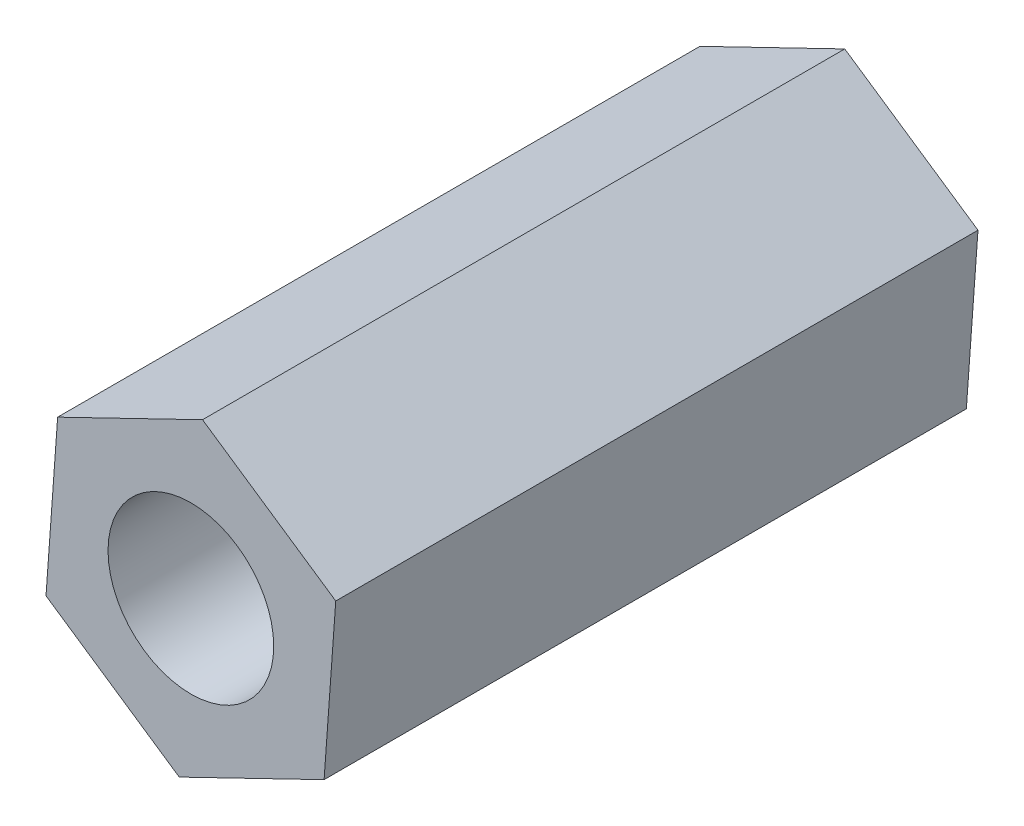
ISO-10303-21;
HEADER;
FILE_DESCRIPTION(('STEP AP214'),'2;1');
FILE_NAME('part.step','',(''),(''),'','','');
FILE_SCHEMA(('AUTOMOTIVE_DESIGN { 1 0 10303 214 1 1 1 1 }'));
ENDSEC;
DATA;
#1=APPLICATION_CONTEXT('core data for automotive mechanical design processes');
#2=APPLICATION_PROTOCOL_DEFINITION('international standard','automotive_design',2000,#1);
#3=PRODUCT_CONTEXT('',#1,'mechanical');
#4=PRODUCT('Part','Part','',(#3));
#5=PRODUCT_RELATED_PRODUCT_CATEGORY('part','',(#4));
#6=PRODUCT_DEFINITION_FORMATION('','',#4);
#7=PRODUCT_DEFINITION_CONTEXT('part definition',#1,'design');
#8=PRODUCT_DEFINITION('design','',#6,#7);
#9=PRODUCT_DEFINITION_SHAPE('','',#8);
#10=(LENGTH_UNIT() NAMED_UNIT(*) SI_UNIT(.MILLI.,.METRE.));
#11=(NAMED_UNIT(*) PLANE_ANGLE_UNIT() SI_UNIT($,.RADIAN.));
#12=(NAMED_UNIT(*) SI_UNIT($,.STERADIAN.) SOLID_ANGLE_UNIT());
#13=UNCERTAINTY_MEASURE_WITH_UNIT(LENGTH_MEASURE(1.E-05),#10,'distance_accuracy_value','');
#14=(GEOMETRIC_REPRESENTATION_CONTEXT(3) GLOBAL_UNCERTAINTY_ASSIGNED_CONTEXT((#13)) GLOBAL_UNIT_ASSIGNED_CONTEXT((#10,
#11,#12)) REPRESENTATION_CONTEXT('',''));
#15=CARTESIAN_POINT('',(0.,0.,0.));
#16=DIRECTION('',(0.,0.,1.));
#17=DIRECTION('',(1.,0.,0.));
#18=AXIS2_PLACEMENT_3D('',#15,#16,#17);
#19=CARTESIAN_POINT('',(0.,0.,10.));
#20=DIRECTION('',(0.,0.,1.));
#21=DIRECTION('',(1.,0.,0.));
#22=AXIS2_PLACEMENT_3D('',#19,#20,#21);
#23=PLANE('',#22);
#24=DIRECTION('',(0.827581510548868,-0.561345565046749,0.));
#25=VECTOR('',#24,1.);
#26=CARTESIAN_POINT('',(-39.3700886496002,-1.09294876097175,10.));
#27=LINE('',#26,#25);
#28=CARTESIAN_POINT('',(-39.3700886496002,-1.09294876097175,10.));
#29=VERTEX_POINT('',#28);
#30=CARTESIAN_POINT('',(-37.2956987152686,-2.49999999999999,10.));
#31=VERTEX_POINT('',#30);
#32=EDGE_CURVE('E129',#29,#31,#27,.T.);
#33=ORIENTED_EDGE('',*,*,#32,.T.);
#34=DIRECTION('',(0.899930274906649,0.436033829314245,0.));
#35=VECTOR('',#34,1.);
#36=CARTESIAN_POINT('',(-37.2956987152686,-2.49999999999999,10.));
#37=LINE('',#36,#35);
#38=CARTESIAN_POINT('',(-35.039961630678,-1.40705123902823,10.));
#39=VERTEX_POINT('',#38);
#40=EDGE_CURVE('E87',#31,#39,#37,.T.);
#41=ORIENTED_EDGE('',*,*,#40,.T.);
#42=DIRECTION('',(0.0723487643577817,0.997379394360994,0.));
#43=VECTOR('',#42,1.);
#44=CARTESIAN_POINT('',(-35.039961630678,-1.40705123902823,10.));
#45=LINE('',#44,#43);
#46=CARTESIAN_POINT('',(-34.858614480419,1.09294876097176,10.));
#47=VERTEX_POINT('',#46);
#48=EDGE_CURVE('E100',#39,#47,#45,.T.);
#49=ORIENTED_EDGE('',*,*,#48,.T.);
#50=DIRECTION('',(-0.827581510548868,0.561345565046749,0.));
#51=VECTOR('',#50,1.);
#52=CARTESIAN_POINT('',(-34.858614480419,1.09294876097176,10.));
#53=LINE('',#52,#51);
#54=CARTESIAN_POINT('',(-36.9330044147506,2.5,10.));
#55=VERTEX_POINT('',#54);
#56=EDGE_CURVE('E94',#47,#55,#53,.T.);
#57=ORIENTED_EDGE('',*,*,#56,.T.);
#58=DIRECTION('',(-0.89993027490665,-0.436033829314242,0.));
#59=VECTOR('',#58,1.);
#60=CARTESIAN_POINT('',(-36.9330044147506,2.5,10.));
#61=LINE('',#60,#59);
#62=CARTESIAN_POINT('',(-39.1887414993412,1.40705123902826,10.));
#63=VERTEX_POINT('',#62);
#64=EDGE_CURVE('E98',#55,#63,#61,.T.);
#65=ORIENTED_EDGE('',*,*,#64,.T.);
#66=DIRECTION('',(-0.072348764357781,-0.997379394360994,0.));
#67=VECTOR('',#66,1.);
#68=CARTESIAN_POINT('',(-39.1887414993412,1.40705123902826,10.));
#69=LINE('',#68,#67);
#70=EDGE_CURVE('E50',#63,#29,#69,.T.);
#71=ORIENTED_EDGE('',*,*,#70,.T.);
#72=EDGE_LOOP('',(#33,#41,#49,#57,#65,#71));
#73=FACE_BOUND('',#72,.T.);
#74=CARTESIAN_POINT('',(-37.1143515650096,0.,10.));
#75=DIRECTION('',(0.,0.,1.));
#76=DIRECTION('',(1.,0.,0.));
#77=AXIS2_PLACEMENT_3D('',#74,#75,#76);
#78=CIRCLE('',#77,1.29);
#79=CARTESIAN_POINT('',(-35.8243515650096,0.,10.));
#80=VERTEX_POINT('',#79);
#81=EDGE_CURVE('E122',#80,#80,#78,.T.);
#82=ORIENTED_EDGE('',*,*,#81,.F.);
#83=EDGE_LOOP('',(#82));
#84=FACE_BOUND('',#83,.T.);
#85=ADVANCED_FACE('F33',(#73,#84),#23,.T.);
#86=CARTESIAN_POINT('',(0.,0.,0.));
#87=DIRECTION('',(0.,0.,1.));
#88=DIRECTION('',(1.,0.,0.));
#89=AXIS2_PLACEMENT_3D('',#86,#87,#88);
#90=PLANE('',#89);
#91=DIRECTION('',(0.827581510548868,-0.561345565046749,0.));
#92=VECTOR('',#91,1.);
#93=CARTESIAN_POINT('',(-39.3700886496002,-1.09294876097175,0.));
#94=LINE('',#93,#92);
#95=CARTESIAN_POINT('',(-39.3700886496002,-1.09294876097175,0.));
#96=VERTEX_POINT('',#95);
#97=CARTESIAN_POINT('',(-37.2956987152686,-2.49999999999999,0.));
#98=VERTEX_POINT('',#97);
#99=EDGE_CURVE('E118',#96,#98,#94,.T.);
#100=ORIENTED_EDGE('',*,*,#99,.F.);
#101=DIRECTION('',(-0.072348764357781,-0.997379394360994,0.));
#102=VECTOR('',#101,1.);
#103=CARTESIAN_POINT('',(-39.1887414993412,1.40705123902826,0.));
#104=LINE('',#103,#102);
#105=CARTESIAN_POINT('',(-39.1887414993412,1.40705123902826,0.));
#106=VERTEX_POINT('',#105);
#107=EDGE_CURVE('E79',#106,#96,#104,.T.);
#108=ORIENTED_EDGE('',*,*,#107,.F.);
#109=DIRECTION('',(-0.89993027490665,-0.436033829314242,0.));
#110=VECTOR('',#109,1.);
#111=CARTESIAN_POINT('',(-36.9330044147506,2.5,0.));
#112=LINE('',#111,#110);
#113=CARTESIAN_POINT('',(-36.9330044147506,2.5,0.));
#114=VERTEX_POINT('',#113);
#115=EDGE_CURVE('E73',#114,#106,#112,.T.);
#116=ORIENTED_EDGE('',*,*,#115,.F.);
#117=DIRECTION('',(-0.827581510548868,0.561345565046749,0.));
#118=VECTOR('',#117,1.);
#119=CARTESIAN_POINT('',(-34.858614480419,1.09294876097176,0.));
#120=LINE('',#119,#118);
#121=CARTESIAN_POINT('',(-34.858614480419,1.09294876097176,0.));
#122=VERTEX_POINT('',#121);
#123=EDGE_CURVE('E108',#122,#114,#120,.T.);
#124=ORIENTED_EDGE('',*,*,#123,.F.);
#125=DIRECTION('',(0.0723487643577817,0.997379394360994,0.));
#126=VECTOR('',#125,1.);
#127=CARTESIAN_POINT('',(-35.039961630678,-1.40705123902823,0.));
#128=LINE('',#127,#126);
#129=CARTESIAN_POINT('',(-35.039961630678,-1.40705123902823,0.));
#130=VERTEX_POINT('',#129);
#131=EDGE_CURVE('E124',#130,#122,#128,.T.);
#132=ORIENTED_EDGE('',*,*,#131,.F.);
#133=DIRECTION('',(0.899930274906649,0.436033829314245,0.));
#134=VECTOR('',#133,1.);
#135=CARTESIAN_POINT('',(-37.2956987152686,-2.49999999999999,0.));
#136=LINE('',#135,#134);
#137=EDGE_CURVE('E121',#98,#130,#136,.T.);
#138=ORIENTED_EDGE('',*,*,#137,.F.);
#139=EDGE_LOOP('',(#100,#108,#116,#124,#132,#138));
#140=FACE_BOUND('',#139,.T.);
#141=CARTESIAN_POINT('',(-37.1143515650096,0.,0.));
#142=DIRECTION('',(0.,0.,1.));
#143=DIRECTION('',(1.,0.,0.));
#144=AXIS2_PLACEMENT_3D('',#141,#142,#143);
#145=CIRCLE('',#144,1.29);
#146=CARTESIAN_POINT('',(-35.8243515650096,0.,0.));
#147=VERTEX_POINT('',#146);
#148=EDGE_CURVE('E222',#147,#147,#145,.T.);
#149=ORIENTED_EDGE('',*,*,#148,.T.);
#150=EDGE_LOOP('',(#149));
#151=FACE_BOUND('',#150,.T.);
#152=ADVANCED_FACE('F138',(#140,#151),#90,.F.);
#153=CARTESIAN_POINT('',(-39.3700886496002,-1.09294876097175,10.));
#154=DIRECTION('',(0.561345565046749,0.827581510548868,0.));
#155=DIRECTION('',(-0.827581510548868,0.561345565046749,0.));
#156=AXIS2_PLACEMENT_3D('',#153,#154,#155);
#157=PLANE('',#156);
#158=ORIENTED_EDGE('',*,*,#99,.T.);
#159=DIRECTION('',(0.,0.,-1.));
#160=VECTOR('',#159,1.);
#161=CARTESIAN_POINT('',(-37.2956987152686,-2.49999999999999,10.));
#162=LINE('',#161,#160);
#163=EDGE_CURVE('E11',#31,#98,#162,.T.);
#164=ORIENTED_EDGE('',*,*,#163,.F.);
#165=ORIENTED_EDGE('',*,*,#32,.F.);
#166=DIRECTION('',(0.,0.,-1.));
#167=VECTOR('',#166,1.);
#168=CARTESIAN_POINT('',(-39.3700886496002,-1.09294876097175,10.));
#169=LINE('',#168,#167);
#170=EDGE_CURVE('E114',#29,#96,#169,.T.);
#171=ORIENTED_EDGE('',*,*,#170,.T.);
#172=EDGE_LOOP('',(#158,#164,#165,#171));
#173=FACE_BOUND('',#172,.T.);
#174=ADVANCED_FACE('F35',(#173),#157,.F.);
#175=CARTESIAN_POINT('',(-37.2956987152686,-2.49999999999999,10.));
#176=DIRECTION('',(-0.436033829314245,0.899930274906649,0.));
#177=DIRECTION('',(-0.899930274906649,-0.436033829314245,0.));
#178=AXIS2_PLACEMENT_3D('',#175,#176,#177);
#179=PLANE('',#178);
#180=ORIENTED_EDGE('',*,*,#137,.T.);
#181=DIRECTION('',(0.,0.,-1.));
#182=VECTOR('',#181,1.);
#183=CARTESIAN_POINT('',(-35.039961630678,-1.40705123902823,10.));
#184=LINE('',#183,#182);
#185=EDGE_CURVE('E42',#39,#130,#184,.T.);
#186=ORIENTED_EDGE('',*,*,#185,.F.);
#187=ORIENTED_EDGE('',*,*,#40,.F.);
#188=ORIENTED_EDGE('',*,*,#163,.T.);
#189=EDGE_LOOP('',(#180,#186,#187,#188));
#190=FACE_BOUND('',#189,.T.);
#191=ADVANCED_FACE('F163',(#190),#179,.F.);
#192=CARTESIAN_POINT('',(-35.039961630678,-1.40705123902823,10.));
#193=DIRECTION('',(-0.997379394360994,0.0723487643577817,0.));
#194=DIRECTION('',(-0.0723487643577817,-0.997379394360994,0.));
#195=AXIS2_PLACEMENT_3D('',#192,#193,#194);
#196=PLANE('',#195);
#197=ORIENTED_EDGE('',*,*,#131,.T.);
#198=DIRECTION('',(0.,0.,-1.));
#199=VECTOR('',#198,1.);
#200=CARTESIAN_POINT('',(-34.858614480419,1.09294876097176,10.));
#201=LINE('',#200,#199);
#202=EDGE_CURVE('E109',#47,#122,#201,.T.);
#203=ORIENTED_EDGE('',*,*,#202,.F.);
#204=ORIENTED_EDGE('',*,*,#48,.F.);
#205=ORIENTED_EDGE('',*,*,#185,.T.);
#206=EDGE_LOOP('',(#197,#203,#204,#205));
#207=FACE_BOUND('',#206,.T.);
#208=ADVANCED_FACE('F135',(#207),#196,.F.);
#209=CARTESIAN_POINT('',(-34.858614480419,1.09294876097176,10.));
#210=DIRECTION('',(-0.561345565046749,-0.827581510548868,0.));
#211=DIRECTION('',(0.827581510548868,-0.56134556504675,0.));
#212=AXIS2_PLACEMENT_3D('',#209,#210,#211);
#213=PLANE('',#212);
#214=ORIENTED_EDGE('',*,*,#123,.T.);
#215=DIRECTION('',(0.,0.,-1.));
#216=VECTOR('',#215,1.);
#217=CARTESIAN_POINT('',(-36.9330044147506,2.5,10.));
#218=LINE('',#217,#216);
#219=EDGE_CURVE('E105',#55,#114,#218,.T.);
#220=ORIENTED_EDGE('',*,*,#219,.F.);
#221=ORIENTED_EDGE('',*,*,#56,.F.);
#222=ORIENTED_EDGE('',*,*,#202,.T.);
#223=EDGE_LOOP('',(#214,#220,#221,#222));
#224=FACE_BOUND('',#223,.T.);
#225=ADVANCED_FACE('F106',(#224),#213,.F.);
#226=CARTESIAN_POINT('',(-36.9330044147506,2.5,10.));
#227=DIRECTION('',(0.436033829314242,-0.89993027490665,0.));
#228=DIRECTION('',(0.89993027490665,0.436033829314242,0.));
#229=AXIS2_PLACEMENT_3D('',#226,#227,#228);
#230=PLANE('',#229);
#231=ORIENTED_EDGE('',*,*,#115,.T.);
#232=DIRECTION('',(0.,0.,-1.));
#233=VECTOR('',#232,1.);
#234=CARTESIAN_POINT('',(-39.1887414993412,1.40705123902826,10.));
#235=LINE('',#234,#233);
#236=EDGE_CURVE('E110',#63,#106,#235,.T.);
#237=ORIENTED_EDGE('',*,*,#236,.F.);
#238=ORIENTED_EDGE('',*,*,#64,.F.);
#239=ORIENTED_EDGE('',*,*,#219,.T.);
#240=EDGE_LOOP('',(#231,#237,#238,#239));
#241=FACE_BOUND('',#240,.T.);
#242=ADVANCED_FACE('F112',(#241),#230,.F.);
#243=CARTESIAN_POINT('',(-39.1887414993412,1.40705123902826,10.));
#244=DIRECTION('',(0.997379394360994,-0.072348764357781,0.));
#245=DIRECTION('',(0.072348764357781,0.997379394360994,0.));
#246=AXIS2_PLACEMENT_3D('',#243,#244,#245);
#247=PLANE('',#246);
#248=ORIENTED_EDGE('',*,*,#107,.T.);
#249=ORIENTED_EDGE('',*,*,#170,.F.);
#250=ORIENTED_EDGE('',*,*,#70,.F.);
#251=ORIENTED_EDGE('',*,*,#236,.T.);
#252=EDGE_LOOP('',(#248,#249,#250,#251));
#253=FACE_BOUND('',#252,.T.);
#254=ADVANCED_FACE('F143',(#253),#247,.F.);
#255=CARTESIAN_POINT('',(-37.1143515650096,0.,10.));
#256=DIRECTION('',(0.,0.,-1.));
#257=DIRECTION('',(-1.,0.,0.));
#258=AXIS2_PLACEMENT_3D('',#255,#256,#257);
#259=CYLINDRICAL_SURFACE('',#258,1.29);
#260=ORIENTED_EDGE('',*,*,#81,.T.);
#261=EDGE_LOOP('',(#260));
#262=FACE_BOUND('',#261,.T.);
#263=ORIENTED_EDGE('',*,*,#148,.F.);
#264=EDGE_LOOP('',(#263));
#265=FACE_BOUND('',#264,.T.);
#266=ADVANCED_FACE('F145',(#262,#265),#259,.F.);
#267=CLOSED_SHELL('',(#85,#152,#174,#191,#208,#225,#242,#254,#266));
#268=MANIFOLD_SOLID_BREP('B2',#267);
#269=ADVANCED_BREP_SHAPE_REPRESENTATION('',(#18,#268),#14);
#270=SHAPE_DEFINITION_REPRESENTATION(#9,#269);
ENDSEC;
END-ISO-10303-21;
